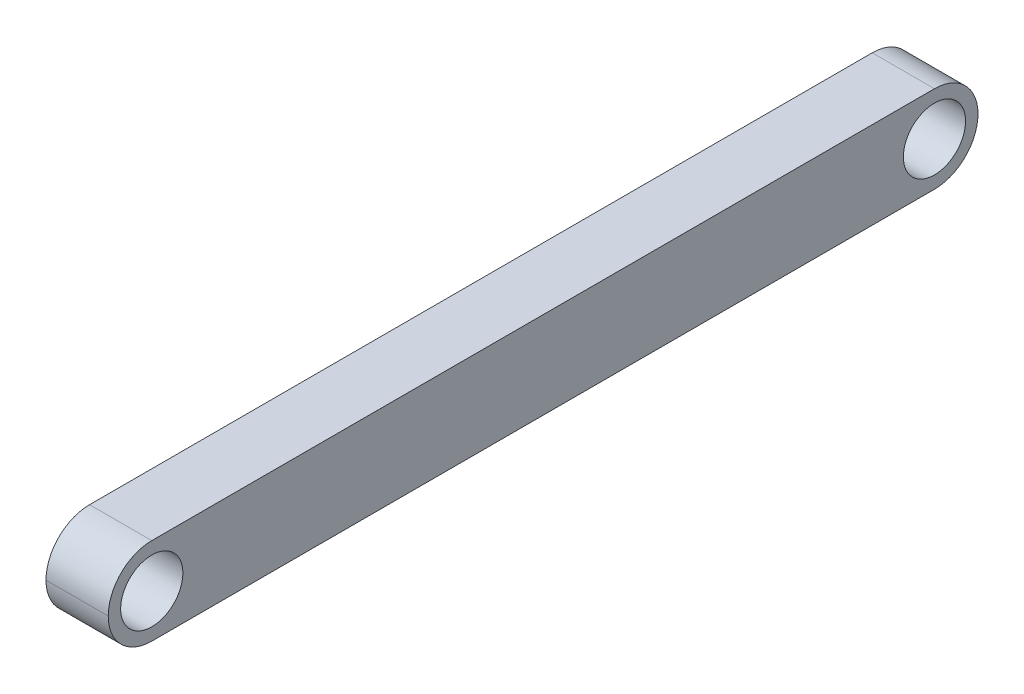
ISO-10303-21;
HEADER;
FILE_DESCRIPTION(('STEP AP214'),'2;1');
FILE_NAME('part.step','',(''),(''),'','','');
FILE_SCHEMA(('AUTOMOTIVE_DESIGN { 1 0 10303 214 1 1 1 1 }'));
ENDSEC;
DATA;
#1=APPLICATION_CONTEXT('core data for automotive mechanical design processes');
#2=APPLICATION_PROTOCOL_DEFINITION('international standard','automotive_design',2000,#1);
#3=PRODUCT_CONTEXT('',#1,'mechanical');
#4=PRODUCT('Part','Part','',(#3));
#5=PRODUCT_RELATED_PRODUCT_CATEGORY('part','',(#4));
#6=PRODUCT_DEFINITION_FORMATION('','',#4);
#7=PRODUCT_DEFINITION_CONTEXT('part definition',#1,'design');
#8=PRODUCT_DEFINITION('design','',#6,#7);
#9=PRODUCT_DEFINITION_SHAPE('','',#8);
#10=(LENGTH_UNIT() NAMED_UNIT(*) SI_UNIT(.MILLI.,.METRE.));
#11=(NAMED_UNIT(*) PLANE_ANGLE_UNIT() SI_UNIT($,.RADIAN.));
#12=(NAMED_UNIT(*) SI_UNIT($,.STERADIAN.) SOLID_ANGLE_UNIT());
#13=UNCERTAINTY_MEASURE_WITH_UNIT(LENGTH_MEASURE(1.E-05),#10,'distance_accuracy_value','');
#14=(GEOMETRIC_REPRESENTATION_CONTEXT(3) GLOBAL_UNCERTAINTY_ASSIGNED_CONTEXT((#13)) GLOBAL_UNIT_ASSIGNED_CONTEXT((#10,
#11,#12)) REPRESENTATION_CONTEXT('',''));
#15=CARTESIAN_POINT('',(0.,0.,0.));
#16=DIRECTION('',(0.,0.,1.));
#17=DIRECTION('',(1.,0.,0.));
#18=AXIS2_PLACEMENT_3D('',#15,#16,#17);
#19=CARTESIAN_POINT('',(25.,0.,0.));
#20=DIRECTION('',(-1.,0.,0.));
#21=DIRECTION('',(0.,0.,1.));
#22=AXIS2_PLACEMENT_3D('',#19,#20,#21);
#23=PLANE('',#22);
#24=CARTESIAN_POINT('',(25.,0.,0.));
#25=DIRECTION('',(-1.,0.,0.));
#26=DIRECTION('',(0.,0.,1.));
#27=AXIS2_PLACEMENT_3D('',#24,#25,#26);
#28=CIRCLE('',#27,35.);
#29=CARTESIAN_POINT('',(25.,35.,0.));
#30=VERTEX_POINT('',#29);
#31=CARTESIAN_POINT('',(25.,0.,35.));
#32=VERTEX_POINT('',#31);
#33=EDGE_CURVE('E132',#30,#32,#28,.F.);
#34=ORIENTED_EDGE('',*,*,#33,.T.);
#35=CARTESIAN_POINT('',(25.,0.,0.));
#36=DIRECTION('',(-1.,0.,0.));
#37=DIRECTION('',(0.,0.,1.));
#38=AXIS2_PLACEMENT_3D('',#35,#36,#37);
#39=CIRCLE('',#38,35.);
#40=CARTESIAN_POINT('',(25.,-35.,0.));
#41=VERTEX_POINT('',#40);
#42=EDGE_CURVE('E134',#32,#41,#39,.F.);
#43=ORIENTED_EDGE('',*,*,#42,.T.);
#44=DIRECTION('',(0.,0.,-1.));
#45=VECTOR('',#44,1.);
#46=CARTESIAN_POINT('',(25.,-35.,-664.));
#47=LINE('',#46,#45);
#48=CARTESIAN_POINT('',(25.,-35.,-629.));
#49=VERTEX_POINT('',#48);
#50=EDGE_CURVE('E106',#41,#49,#47,.T.);
#51=ORIENTED_EDGE('',*,*,#50,.T.);
#52=CARTESIAN_POINT('',(25.,0.,-629.));
#53=DIRECTION('',(-1.,0.,0.));
#54=DIRECTION('',(0.,0.,1.));
#55=AXIS2_PLACEMENT_3D('',#52,#53,#54);
#56=CIRCLE('',#55,35.);
#57=CARTESIAN_POINT('',(25.,0.,-664.));
#58=VERTEX_POINT('',#57);
#59=EDGE_CURVE('E130',#49,#58,#56,.F.);
#60=ORIENTED_EDGE('',*,*,#59,.T.);
#61=CARTESIAN_POINT('',(25.,0.,-629.));
#62=DIRECTION('',(-1.,0.,0.));
#63=DIRECTION('',(0.,0.,1.));
#64=AXIS2_PLACEMENT_3D('',#61,#62,#63);
#65=CIRCLE('',#64,35.);
#66=CARTESIAN_POINT('',(25.,35.,-629.));
#67=VERTEX_POINT('',#66);
#68=EDGE_CURVE('E54',#58,#67,#65,.F.);
#69=ORIENTED_EDGE('',*,*,#68,.T.);
#70=DIRECTION('',(0.,0.,1.));
#71=VECTOR('',#70,1.);
#72=CARTESIAN_POINT('',(25.,35.,-664.));
#73=LINE('',#72,#71);
#74=EDGE_CURVE('E122',#67,#30,#73,.T.);
#75=ORIENTED_EDGE('',*,*,#74,.T.);
#76=EDGE_LOOP('',(#34,#43,#51,#60,#69,#75));
#77=FACE_BOUND('',#76,.T.);
#78=CARTESIAN_POINT('',(25.,0.,0.));
#79=DIRECTION('',(1.,0.,0.));
#80=DIRECTION('',(0.,0.,-1.));
#81=AXIS2_PLACEMENT_3D('',#78,#79,#80);
#82=CIRCLE('',#81,25.);
#83=CARTESIAN_POINT('',(25.,0.,-25.));
#84=VERTEX_POINT('',#83);
#85=EDGE_CURVE('E115',#84,#84,#82,.T.);
#86=ORIENTED_EDGE('',*,*,#85,.F.);
#87=EDGE_LOOP('',(#86));
#88=FACE_BOUND('',#87,.T.);
#89=CARTESIAN_POINT('',(25.,0.,-629.));
#90=DIRECTION('',(1.,0.,0.));
#91=DIRECTION('',(0.,0.,-1.));
#92=AXIS2_PLACEMENT_3D('',#89,#90,#91);
#93=CIRCLE('',#92,25.);
#94=CARTESIAN_POINT('',(25.,0.,-654.));
#95=VERTEX_POINT('',#94);
#96=EDGE_CURVE('E138',#95,#95,#93,.T.);
#97=ORIENTED_EDGE('',*,*,#96,.F.);
#98=EDGE_LOOP('',(#97));
#99=FACE_BOUND('',#98,.T.);
#100=ADVANCED_FACE('F32',(#77,#88,#99),#23,.F.);
#101=CARTESIAN_POINT('',(-25.,0.,0.));
#102=DIRECTION('',(-1.,0.,0.));
#103=DIRECTION('',(0.,0.,1.));
#104=AXIS2_PLACEMENT_3D('',#101,#102,#103);
#105=PLANE('',#104);
#106=CARTESIAN_POINT('',(-25.,0.,0.));
#107=DIRECTION('',(1.,0.,0.));
#108=DIRECTION('',(0.,0.,-1.));
#109=AXIS2_PLACEMENT_3D('',#106,#107,#108);
#110=CIRCLE('',#109,25.);
#111=CARTESIAN_POINT('',(-25.,0.,-25.));
#112=VERTEX_POINT('',#111);
#113=EDGE_CURVE('E119',#112,#112,#110,.T.);
#114=ORIENTED_EDGE('',*,*,#113,.T.);
#115=EDGE_LOOP('',(#114));
#116=FACE_BOUND('',#115,.T.);
#117=DIRECTION('',(0.,0.,-1.));
#118=VECTOR('',#117,1.);
#119=CARTESIAN_POINT('',(-25.,-35.,-664.));
#120=LINE('',#119,#118);
#121=CARTESIAN_POINT('',(-25.,-35.,0.));
#122=VERTEX_POINT('',#121);
#123=CARTESIAN_POINT('',(-25.,-35.,-629.));
#124=VERTEX_POINT('',#123);
#125=EDGE_CURVE('E103',#122,#124,#120,.T.);
#126=ORIENTED_EDGE('',*,*,#125,.F.);
#127=CARTESIAN_POINT('',(-25.,0.,0.));
#128=DIRECTION('',(-1.,0.,0.));
#129=DIRECTION('',(0.,0.,1.));
#130=AXIS2_PLACEMENT_3D('',#127,#128,#129);
#131=CIRCLE('',#130,35.);
#132=CARTESIAN_POINT('',(-25.,0.,35.));
#133=VERTEX_POINT('',#132);
#134=EDGE_CURVE('E86',#122,#133,#131,.T.);
#135=ORIENTED_EDGE('',*,*,#134,.T.);
#136=CARTESIAN_POINT('',(-25.,0.,0.));
#137=DIRECTION('',(-1.,0.,0.));
#138=DIRECTION('',(0.,0.,1.));
#139=AXIS2_PLACEMENT_3D('',#136,#137,#138);
#140=CIRCLE('',#139,35.);
#141=CARTESIAN_POINT('',(-25.,35.,0.));
#142=VERTEX_POINT('',#141);
#143=EDGE_CURVE('E96',#133,#142,#140,.T.);
#144=ORIENTED_EDGE('',*,*,#143,.T.);
#145=DIRECTION('',(0.,0.,1.));
#146=VECTOR('',#145,1.);
#147=CARTESIAN_POINT('',(-25.,35.,-664.));
#148=LINE('',#147,#146);
#149=CARTESIAN_POINT('',(-25.,35.,-629.));
#150=VERTEX_POINT('',#149);
#151=EDGE_CURVE('E114',#150,#142,#148,.T.);
#152=ORIENTED_EDGE('',*,*,#151,.F.);
#153=CARTESIAN_POINT('',(-25.,0.,-629.));
#154=DIRECTION('',(-1.,0.,0.));
#155=DIRECTION('',(0.,0.,1.));
#156=AXIS2_PLACEMENT_3D('',#153,#154,#155);
#157=CIRCLE('',#156,35.);
#158=CARTESIAN_POINT('',(-25.,0.,-664.));
#159=VERTEX_POINT('',#158);
#160=EDGE_CURVE('E107',#150,#159,#157,.T.);
#161=ORIENTED_EDGE('',*,*,#160,.T.);
#162=CARTESIAN_POINT('',(-25.,0.,-629.));
#163=DIRECTION('',(-1.,0.,0.));
#164=DIRECTION('',(0.,0.,1.));
#165=AXIS2_PLACEMENT_3D('',#162,#163,#164);
#166=CIRCLE('',#165,35.);
#167=EDGE_CURVE('E113',#159,#124,#166,.T.);
#168=ORIENTED_EDGE('',*,*,#167,.T.);
#169=EDGE_LOOP('',(#126,#135,#144,#152,#161,#168));
#170=FACE_BOUND('',#169,.T.);
#171=CARTESIAN_POINT('',(-25.,0.,-629.));
#172=DIRECTION('',(1.,0.,0.));
#173=DIRECTION('',(0.,0.,-1.));
#174=AXIS2_PLACEMENT_3D('',#171,#172,#173);
#175=CIRCLE('',#174,25.);
#176=CARTESIAN_POINT('',(-25.,0.,-654.));
#177=VERTEX_POINT('',#176);
#178=EDGE_CURVE('E136',#177,#177,#175,.T.);
#179=ORIENTED_EDGE('',*,*,#178,.T.);
#180=EDGE_LOOP('',(#179));
#181=FACE_BOUND('',#180,.T.);
#182=ADVANCED_FACE('F110',(#116,#170,#181),#105,.T.);
#183=CARTESIAN_POINT('',(25.,-35.,-664.));
#184=DIRECTION('',(0.,1.,0.));
#185=DIRECTION('',(0.,0.,1.));
#186=AXIS2_PLACEMENT_3D('',#183,#184,#185);
#187=PLANE('',#186);
#188=ORIENTED_EDGE('',*,*,#50,.F.);
#189=DIRECTION('',(-1.,0.,0.));
#190=VECTOR('',#189,1.);
#191=CARTESIAN_POINT('',(25.,-35.,0.));
#192=LINE('',#191,#190);
#193=EDGE_CURVE('E90',#41,#122,#192,.T.);
#194=ORIENTED_EDGE('',*,*,#193,.T.);
#195=ORIENTED_EDGE('',*,*,#125,.T.);
#196=DIRECTION('',(-1.,0.,0.));
#197=VECTOR('',#196,1.);
#198=CARTESIAN_POINT('',(25.,-35.,-629.));
#199=LINE('',#198,#197);
#200=EDGE_CURVE('E108',#124,#49,#199,.F.);
#201=ORIENTED_EDGE('',*,*,#200,.T.);
#202=EDGE_LOOP('',(#188,#194,#195,#201));
#203=FACE_BOUND('',#202,.T.);
#204=ADVANCED_FACE('F101',(#203),#187,.F.);
#205=CARTESIAN_POINT('',(25.,35.,-664.));
#206=DIRECTION('',(0.,-1.,0.));
#207=DIRECTION('',(0.,0.,-1.));
#208=AXIS2_PLACEMENT_3D('',#205,#206,#207);
#209=PLANE('',#208);
#210=ORIENTED_EDGE('',*,*,#151,.T.);
#211=DIRECTION('',(-1.,0.,0.));
#212=VECTOR('',#211,1.);
#213=CARTESIAN_POINT('',(25.,35.,0.));
#214=LINE('',#213,#212);
#215=EDGE_CURVE('E11',#142,#30,#214,.F.);
#216=ORIENTED_EDGE('',*,*,#215,.T.);
#217=ORIENTED_EDGE('',*,*,#74,.F.);
#218=DIRECTION('',(-1.,0.,0.));
#219=VECTOR('',#218,1.);
#220=CARTESIAN_POINT('',(25.,35.,-629.));
#221=LINE('',#220,#219);
#222=EDGE_CURVE('E41',#67,#150,#221,.T.);
#223=ORIENTED_EDGE('',*,*,#222,.T.);
#224=EDGE_LOOP('',(#210,#216,#217,#223));
#225=FACE_BOUND('',#224,.T.);
#226=ADVANCED_FACE('F148',(#225),#209,.F.);
#227=CARTESIAN_POINT('',(25.,0.,0.));
#228=DIRECTION('',(-1.,0.,0.));
#229=DIRECTION('',(0.,0.,1.));
#230=AXIS2_PLACEMENT_3D('',#227,#228,#229);
#231=CYLINDRICAL_SURFACE('',#230,25.);
#232=ORIENTED_EDGE('',*,*,#85,.T.);
#233=EDGE_LOOP('',(#232));
#234=FACE_BOUND('',#233,.T.);
#235=ORIENTED_EDGE('',*,*,#113,.F.);
#236=EDGE_LOOP('',(#235));
#237=FACE_BOUND('',#236,.T.);
#238=ADVANCED_FACE('F170',(#234,#237),#231,.F.);
#239=CARTESIAN_POINT('',(25.,0.,-629.));
#240=DIRECTION('',(-1.,0.,0.));
#241=DIRECTION('',(0.,0.,1.));
#242=AXIS2_PLACEMENT_3D('',#239,#240,#241);
#243=CYLINDRICAL_SURFACE('',#242,25.);
#244=ORIENTED_EDGE('',*,*,#96,.T.);
#245=EDGE_LOOP('',(#244));
#246=FACE_BOUND('',#245,.T.);
#247=ORIENTED_EDGE('',*,*,#178,.F.);
#248=EDGE_LOOP('',(#247));
#249=FACE_BOUND('',#248,.T.);
#250=ADVANCED_FACE('F159',(#246,#249),#243,.F.);
#251=CARTESIAN_POINT('',(25.,0.,0.));
#252=DIRECTION('',(-1.,0.,0.));
#253=DIRECTION('',(0.,0.,1.));
#254=AXIS2_PLACEMENT_3D('',#251,#252,#253);
#255=CYLINDRICAL_SURFACE('',#254,35.);
#256=DIRECTION('',(-1.,0.,0.));
#257=VECTOR('',#256,1.);
#258=CARTESIAN_POINT('',(25.,0.,35.));
#259=LINE('',#258,#257);
#260=EDGE_CURVE('E92',#32,#133,#259,.T.);
#261=ORIENTED_EDGE('',*,*,#260,.F.);
#262=ORIENTED_EDGE('',*,*,#33,.F.);
#263=ORIENTED_EDGE('',*,*,#215,.F.);
#264=ORIENTED_EDGE('',*,*,#143,.F.);
#265=EDGE_LOOP('',(#261,#262,#263,#264));
#266=FACE_BOUND('',#265,.T.);
#267=ADVANCED_FACE('F150',(#266),#255,.T.);
#268=CARTESIAN_POINT('',(25.,0.,0.));
#269=DIRECTION('',(-1.,0.,0.));
#270=DIRECTION('',(0.,0.,1.));
#271=AXIS2_PLACEMENT_3D('',#268,#269,#270);
#272=CYLINDRICAL_SURFACE('',#271,35.);
#273=ORIENTED_EDGE('',*,*,#42,.F.);
#274=ORIENTED_EDGE('',*,*,#260,.T.);
#275=ORIENTED_EDGE('',*,*,#134,.F.);
#276=ORIENTED_EDGE('',*,*,#193,.F.);
#277=EDGE_LOOP('',(#273,#274,#275,#276));
#278=FACE_BOUND('',#277,.T.);
#279=ADVANCED_FACE('F89',(#278),#272,.T.);
#280=CARTESIAN_POINT('',(25.,0.,-629.));
#281=DIRECTION('',(-1.,0.,0.));
#282=DIRECTION('',(0.,0.,1.));
#283=AXIS2_PLACEMENT_3D('',#280,#281,#282);
#284=CYLINDRICAL_SURFACE('',#283,35.);
#285=ORIENTED_EDGE('',*,*,#222,.F.);
#286=ORIENTED_EDGE('',*,*,#68,.F.);
#287=DIRECTION('',(-1.,0.,0.));
#288=VECTOR('',#287,1.);
#289=CARTESIAN_POINT('',(25.,0.,-664.));
#290=LINE('',#289,#288);
#291=EDGE_CURVE('E36',#159,#58,#290,.F.);
#292=ORIENTED_EDGE('',*,*,#291,.F.);
#293=ORIENTED_EDGE('',*,*,#160,.F.);
#294=EDGE_LOOP('',(#285,#286,#292,#293));
#295=FACE_BOUND('',#294,.T.);
#296=ADVANCED_FACE('F34',(#295),#284,.T.);
#297=CARTESIAN_POINT('',(25.,0.,-629.));
#298=DIRECTION('',(-1.,0.,0.));
#299=DIRECTION('',(0.,0.,1.));
#300=AXIS2_PLACEMENT_3D('',#297,#298,#299);
#301=CYLINDRICAL_SURFACE('',#300,35.);
#302=ORIENTED_EDGE('',*,*,#59,.F.);
#303=ORIENTED_EDGE('',*,*,#200,.F.);
#304=ORIENTED_EDGE('',*,*,#167,.F.);
#305=ORIENTED_EDGE('',*,*,#291,.T.);
#306=EDGE_LOOP('',(#302,#303,#304,#305));
#307=FACE_BOUND('',#306,.T.);
#308=ADVANCED_FACE('F143',(#307),#301,.T.);
#309=CLOSED_SHELL('',(#100,#182,#204,#226,#238,#250,#267,#279,#296,#308));
#310=MANIFOLD_SOLID_BREP('B2',#309);
#311=ADVANCED_BREP_SHAPE_REPRESENTATION('',(#18,#310),#14);
#312=SHAPE_DEFINITION_REPRESENTATION(#9,#311);
ENDSEC;
END-ISO-10303-21;
